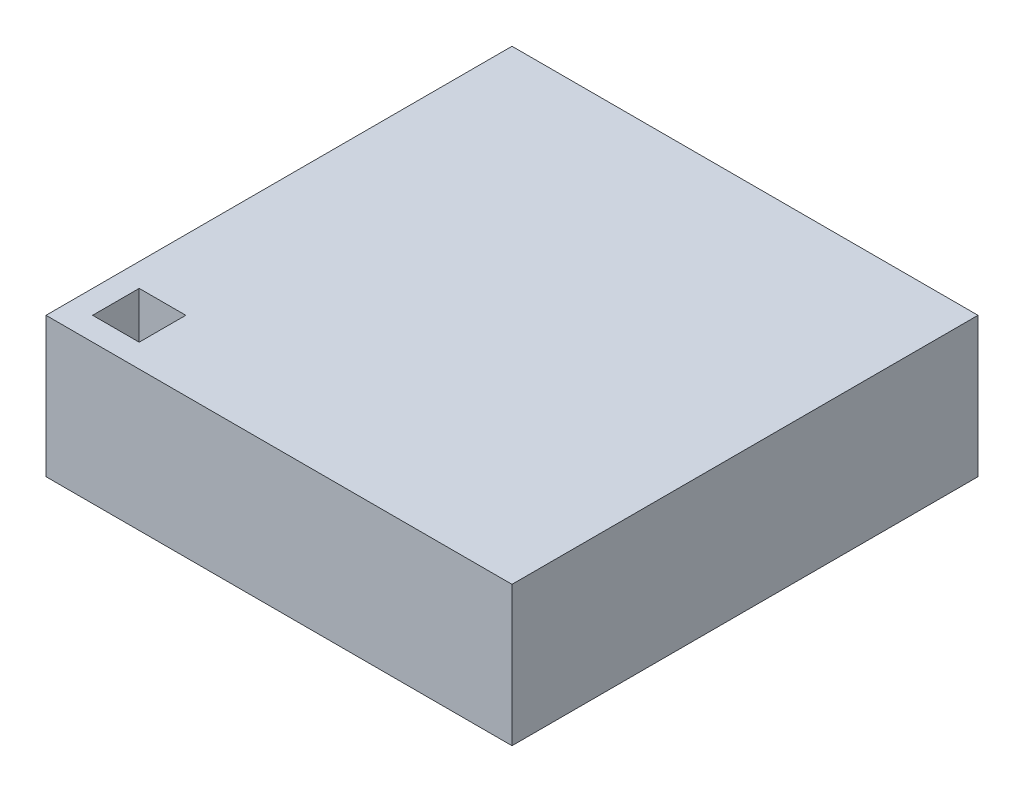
from build123d import *

# Parameters (mm, degrees)
SKETCH1_W          = 100
SKETCH1_H          = 100
EXTRUDE1_DEPTH     = 30
SKETCH2_W          = 10
SKETCH2_H          = 10
CUT_EXTRUDE1_DEPTH = 77.811457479


with BuildPart() as part:
    # Sketch1 → Extrude1 (new body)
    with BuildSketch(Plane(origin=(0, 0, 0), x_dir=(1, 0, 0), z_dir=(0, 1, 0))):
        Rectangle(SKETCH1_W, SKETCH1_H)
    extrude(amount=EXTRUDE1_DEPTH)

    # Sketch2 → Cut-Extrude1 (cut, through all)
    with BuildSketch(Plane(origin=(0, 30, 0), x_dir=(-1, 0, 0), z_dir=(0, 1, 0))):
        with Locations((40, 40)):
            Rectangle(SKETCH2_W, SKETCH2_H)
    extrude(amount=-CUT_EXTRUDE1_DEPTH, mode=Mode.SUBTRACT)


solid = part.part
